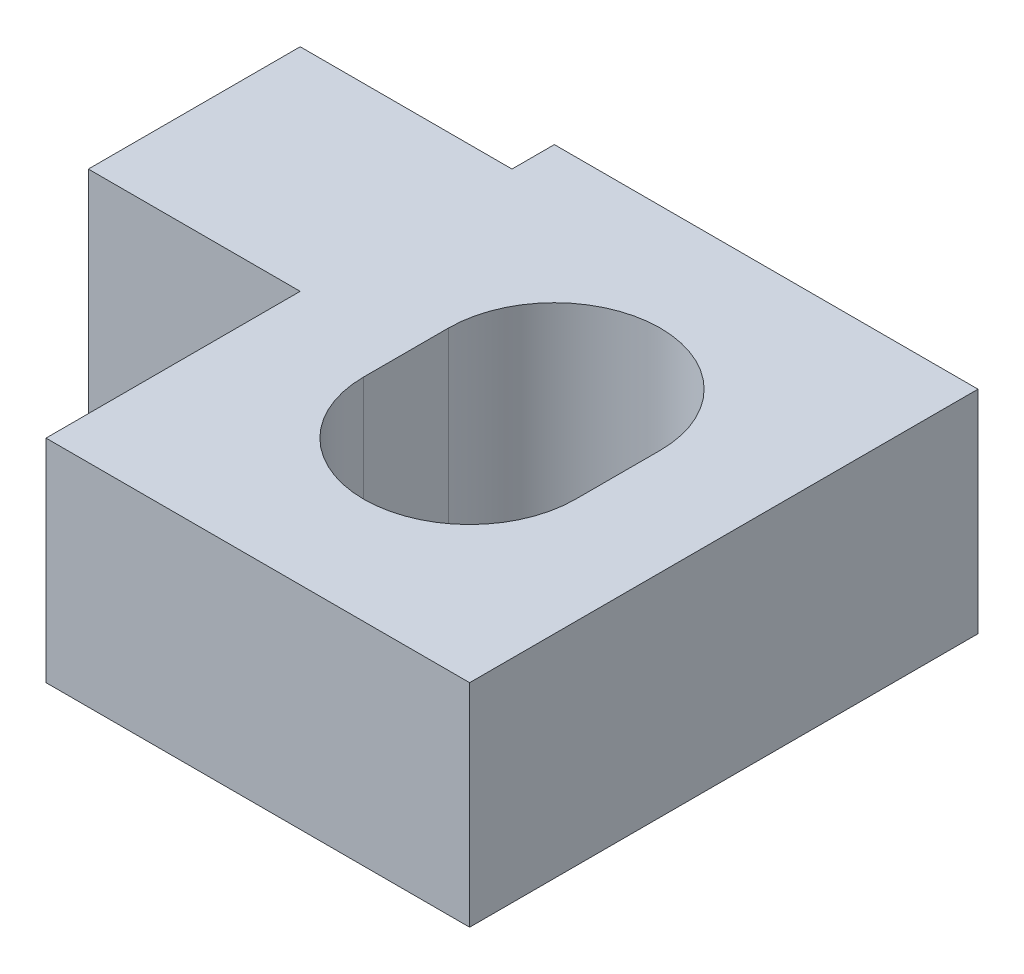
from build123d import *

# Parameters (mm, degrees)
BOSS_EXTRUDE1_DEPTH = 5


with BuildPart() as part:
    # Sketch1 → Boss-Extrude1 (new body)
    with BuildSketch(Plane(origin=(0, 0, 0), x_dir=(1, 0, 0), z_dir=(0, 1, 0))):
        Polygon((5, 6), (5, -6), (-5, -6), (-5, 0), (-10, 0), (-10, 5), (-5, 5), (-5, 6), align=None)
        with BuildLine():
            Line((-2.5, -1), (-2.5, 1))
            ThreePointArc((-2.5, 1), (0, 3.5), (2.5, 1))
            Line((2.5, 1), (2.5, -1))
            ThreePointArc((2.5, -1), (0, -3.5), (-2.5, -1))
        make_face(mode=Mode.SUBTRACT)
    extrude(amount=BOSS_EXTRUDE1_DEPTH)


solid = part.part
